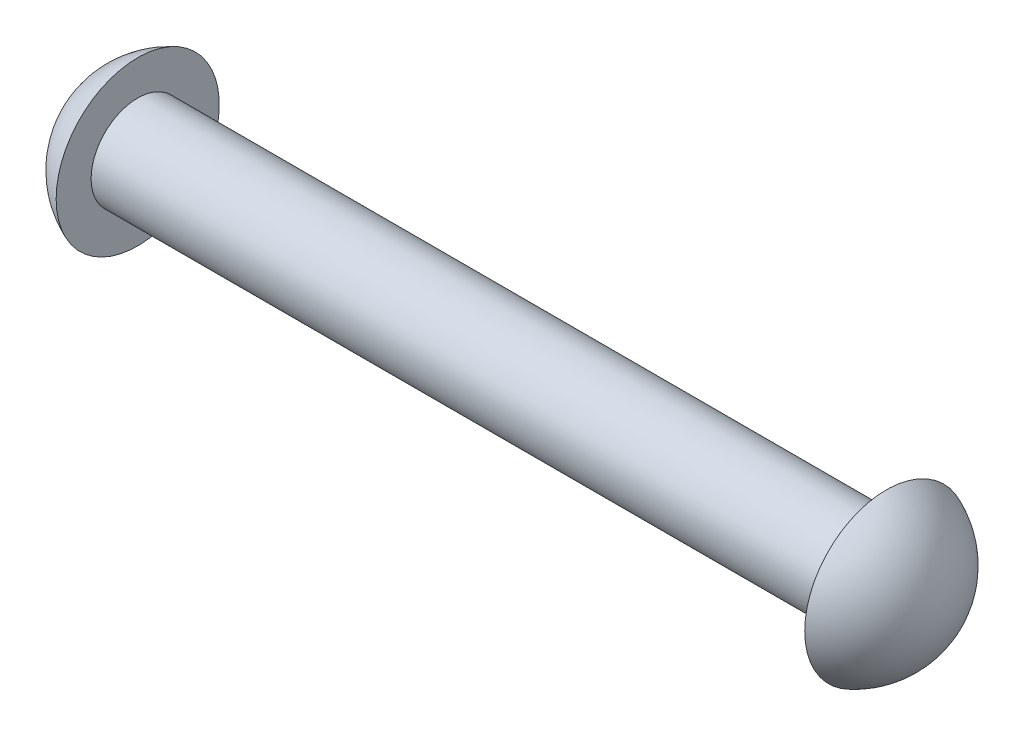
ISO-10303-21;
HEADER;
FILE_DESCRIPTION(('STEP AP214'),'2;1');
FILE_NAME('part.step','',(''),(''),'','','');
FILE_SCHEMA(('AUTOMOTIVE_DESIGN { 1 0 10303 214 1 1 1 1 }'));
ENDSEC;
DATA;
#1=APPLICATION_CONTEXT('core data for automotive mechanical design processes');
#2=APPLICATION_PROTOCOL_DEFINITION('international standard','automotive_design',2000,#1);
#3=PRODUCT_CONTEXT('',#1,'mechanical');
#4=PRODUCT('Part','Part','',(#3));
#5=PRODUCT_RELATED_PRODUCT_CATEGORY('part','',(#4));
#6=PRODUCT_DEFINITION_FORMATION('','',#4);
#7=PRODUCT_DEFINITION_CONTEXT('part definition',#1,'design');
#8=PRODUCT_DEFINITION('design','',#6,#7);
#9=PRODUCT_DEFINITION_SHAPE('','',#8);
#10=(LENGTH_UNIT() NAMED_UNIT(*) SI_UNIT(.MILLI.,.METRE.));
#11=(NAMED_UNIT(*) PLANE_ANGLE_UNIT() SI_UNIT($,.RADIAN.));
#12=(NAMED_UNIT(*) SI_UNIT($,.STERADIAN.) SOLID_ANGLE_UNIT());
#13=UNCERTAINTY_MEASURE_WITH_UNIT(LENGTH_MEASURE(1.E-05),#10,'distance_accuracy_value','');
#14=(GEOMETRIC_REPRESENTATION_CONTEXT(3) GLOBAL_UNCERTAINTY_ASSIGNED_CONTEXT((#13)) GLOBAL_UNIT_ASSIGNED_CONTEXT((#10,
#11,#12)) REPRESENTATION_CONTEXT('',''));
#15=CARTESIAN_POINT('',(0.,0.,0.));
#16=DIRECTION('',(0.,0.,1.));
#17=DIRECTION('',(1.,0.,0.));
#18=AXIS2_PLACEMENT_3D('',#15,#16,#17);
#19=CARTESIAN_POINT('',(-39.,0.,0.));
#20=DIRECTION('',(-1.,0.,0.));
#21=DIRECTION('',(0.,0.,1.));
#22=AXIS2_PLACEMENT_3D('',#19,#20,#21);
#23=CYLINDRICAL_SURFACE('',#22,1.);
#24=CARTESIAN_POINT('',(-16.06,0.,0.));
#25=DIRECTION('',(-1.,0.,0.));
#26=DIRECTION('',(0.,0.,1.));
#27=AXIS2_PLACEMENT_3D('',#24,#25,#26);
#28=CIRCLE('',#27,1.);
#29=CARTESIAN_POINT('',(-16.06,0.,1.));
#30=VERTEX_POINT('',#29);
#31=EDGE_CURVE('E11',#30,#30,#28,.T.);
#32=ORIENTED_EDGE('',*,*,#31,.F.);
#33=EDGE_LOOP('',(#32));
#34=FACE_BOUND('',#33,.T.);
#35=CARTESIAN_POINT('',(0.,0.,0.));
#36=DIRECTION('',(1.,0.,0.));
#37=DIRECTION('',(0.,0.,-1.));
#38=AXIS2_PLACEMENT_3D('',#35,#36,#37);
#39=CIRCLE('',#38,1.);
#40=CARTESIAN_POINT('',(0.,0.,-1.));
#41=VERTEX_POINT('',#40);
#42=EDGE_CURVE('E69',#41,#41,#39,.T.);
#43=ORIENTED_EDGE('',*,*,#42,.F.);
#44=EDGE_LOOP('',(#43));
#45=FACE_BOUND('',#44,.T.);
#46=ADVANCED_FACE('F33',(#34,#45),#23,.T.);
#47=CARTESIAN_POINT('',(-16.06,1.,0.));
#48=DIRECTION('',(-1.,0.,0.));
#49=DIRECTION('',(0.,0.,1.));
#50=AXIS2_PLACEMENT_3D('',#47,#48,#49);
#51=PLANE('',#50);
#52=CARTESIAN_POINT('',(-16.06,0.,0.));
#53=DIRECTION('',(-1.,0.,0.));
#54=DIRECTION('',(0.,0.,1.));
#55=AXIS2_PLACEMENT_3D('',#52,#53,#54);
#56=CIRCLE('',#55,1.75);
#57=CARTESIAN_POINT('',(-16.06,0.,1.75));
#58=VERTEX_POINT('',#57);
#59=EDGE_CURVE('E40',#58,#58,#56,.T.);
#60=ORIENTED_EDGE('',*,*,#59,.F.);
#61=EDGE_LOOP('',(#60));
#62=FACE_BOUND('',#61,.T.);
#63=ORIENTED_EDGE('',*,*,#31,.T.);
#64=EDGE_LOOP('',(#63));
#65=FACE_BOUND('',#64,.T.);
#66=ADVANCED_FACE('F59',(#62,#65),#51,.F.);
#67=CARTESIAN_POINT('',(-15.3600706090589,0.,-0.0163801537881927));
#68=DIRECTION('',(0.,-1.,0.));
#69=DIRECTION('',(0.,0.,1.));
#70=AXIS2_PLACEMENT_3D('',#67,#68,#69);
#71=CIRCLE('',#70,1.9);
#72=TRIMMED_CURVE('',#71,(PARAMETER_VALUE(-1.56217508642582)),
(PARAMETER_VALUE(1.56217508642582)),.T.,.PARAMETER.);
#73=CARTESIAN_POINT('',(-15.3600706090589,0.,0.));
#74=DIRECTION('',(-1.,0.,0.));
#75=AXIS1_PLACEMENT('',#73,#74);
#76=SURFACE_OF_REVOLUTION('',#72,#75);
#77=CARTESIAN_POINT('',(-17.26,0.,0.));
#78=VERTEX_POINT('',#77);
#79=VERTEX_LOOP('',#78);
#80=FACE_BOUND('',#79,.T.);
#81=ORIENTED_EDGE('',*,*,#59,.T.);
#82=EDGE_LOOP('',(#81));
#83=FACE_BOUND('',#82,.T.);
#84=ADVANCED_FACE('F54',(#80,#83),#76,.T.);
#85=CARTESIAN_POINT('',(0.,0.,0.));
#86=DIRECTION('',(1.,0.,0.));
#87=DIRECTION('',(0.,0.,-1.));
#88=AXIS2_PLACEMENT_3D('',#85,#86,#87);
#89=PLANE('',#88);
#90=CARTESIAN_POINT('',(0.,0.,0.));
#91=DIRECTION('',(-1.,0.,0.));
#92=DIRECTION('',(0.,0.,1.));
#93=AXIS2_PLACEMENT_3D('',#90,#91,#92);
#94=CIRCLE('',#93,1.75);
#95=CARTESIAN_POINT('',(0.,0.,1.75));
#96=VERTEX_POINT('',#95);
#97=EDGE_CURVE('E71',#96,#96,#94,.T.);
#98=ORIENTED_EDGE('',*,*,#97,.T.);
#99=EDGE_LOOP('',(#98));
#100=FACE_BOUND('',#99,.T.);
#101=ORIENTED_EDGE('',*,*,#42,.T.);
#102=EDGE_LOOP('',(#101));
#103=FACE_BOUND('',#102,.T.);
#104=ADVANCED_FACE('F48',(#100,#103),#89,.F.);
#105=CARTESIAN_POINT('',(-0.699929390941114,0.,-0.0163801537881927));
#106=DIRECTION('',(0.,-1.,0.));
#107=DIRECTION('',(0.,0.,1.));
#108=AXIS2_PLACEMENT_3D('',#105,#106,#107);
#109=CIRCLE('',#108,1.9);
#110=TRIMMED_CURVE('',#109,(PARAMETER_VALUE(-1.56217508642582)),
(PARAMETER_VALUE(1.56217508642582)),.T.,.PARAMETER.);
#111=CARTESIAN_POINT('',(-0.699929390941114,0.,0.));
#112=DIRECTION('',(-1.,0.,0.));
#113=AXIS1_PLACEMENT('',#111,#112);
#114=SURFACE_OF_REVOLUTION('',#110,#113);
#115=ORIENTED_EDGE('',*,*,#97,.F.);
#116=EDGE_LOOP('',(#115));
#117=FACE_BOUND('',#116,.T.);
#118=CARTESIAN_POINT('',(1.2,0.,0.));
#119=VERTEX_POINT('',#118);
#120=VERTEX_LOOP('',#119);
#121=FACE_BOUND('',#120,.T.);
#122=ADVANCED_FACE('F46',(#117,#121),#114,.T.);
#123=CLOSED_SHELL('',(#46,#66,#84,#104,#122));
#124=MANIFOLD_SOLID_BREP('B2',#123);
#125=ADVANCED_BREP_SHAPE_REPRESENTATION('',(#18,#124),#14);
#126=SHAPE_DEFINITION_REPRESENTATION(#9,#125);
ENDSEC;
END-ISO-10303-21;
